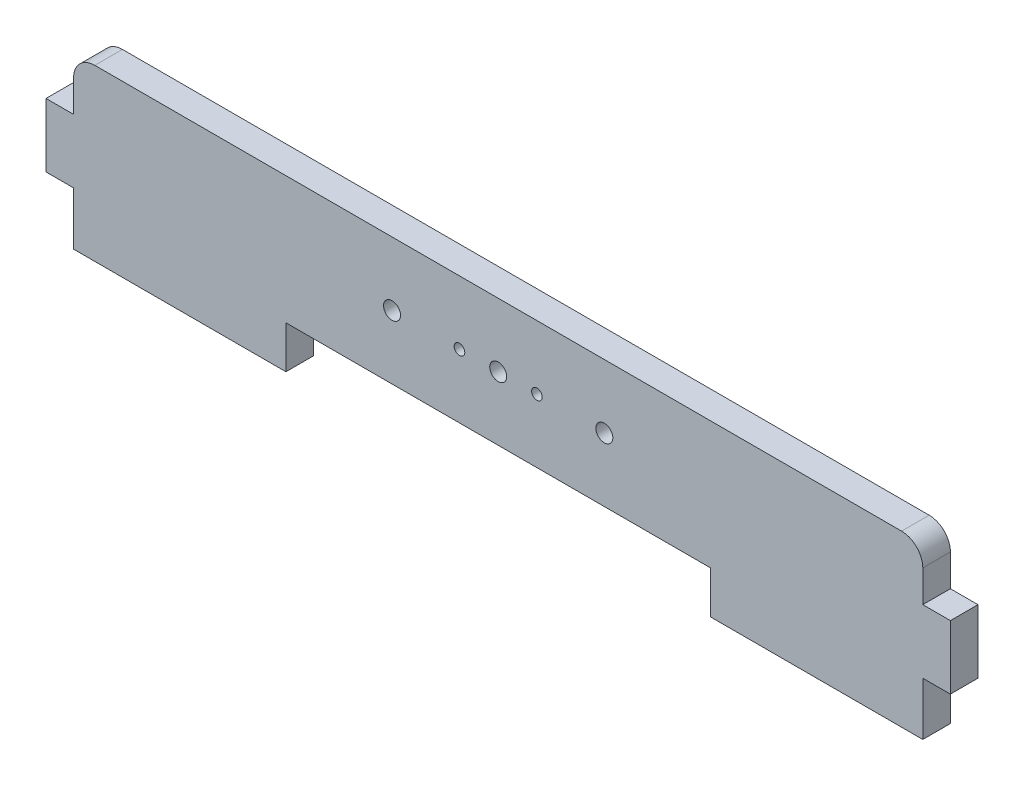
from build123d import *

# Parameters (mm, degrees)
SALIENTE_EXTRUIR1_DEPTH = 13
CROQUIS2_R              = 4
CROQUIS2_R_2            = 2.5
CORTAR_EXTRUIR1_DEPTH   = 13
REDONDEO1_R             = 10
REDONDEO2_R             = 10


with BuildPart() as part:
    # Croquis1 → Saliente-Extruir1 (new body)
    with BuildSketch(Plane.XY):
        Polygon((100, -40), (200, -40), (200, -15), (213, -15), (213, 15), (200, 15), (200, 40), (-200, 40), (-200, 15), (-213, 15), (-213, -15), (-200, -15), (-200, -40), (-100, -40), (-100, -20), (100, -20), align=None)
    extrude(amount=SALIENTE_EXTRUIR1_DEPTH)

    # Croquis2 → Cortar-Extruir1 (cut)
    with BuildSketch(Plane(origin=(0, 0, 0), x_dir=(-1, 0, 0), z_dir=(0, 0, -1))):
        with Locations((0, 10)):
            Circle(CROQUIS2_R)
        with Locations((50, 10)):
            Circle(CROQUIS2_R)
        with Locations((-50, 10)):
            Circle(CROQUIS2_R)
        with Locations((18.25, 10)):
            Circle(CROQUIS2_R_2)
        with Locations((-18.25, 10)):
            Circle(CROQUIS2_R_2)
    extrude(amount=-CORTAR_EXTRUIR1_DEPTH, mode=Mode.SUBTRACT)

    # Redondeo1
    redondeo1_edges = [part.edges().sort_by_distance(p)[0] for p in [
        (-200, 40, 6.5),
    ]]
    fillet(redondeo1_edges, radius=REDONDEO1_R)

    # Redondeo2
    redondeo2_edges = [part.edges().sort_by_distance(p)[0] for p in [
        (200, 40, 6.5),
    ]]
    fillet(redondeo2_edges, radius=REDONDEO2_R)


solid = part.part
